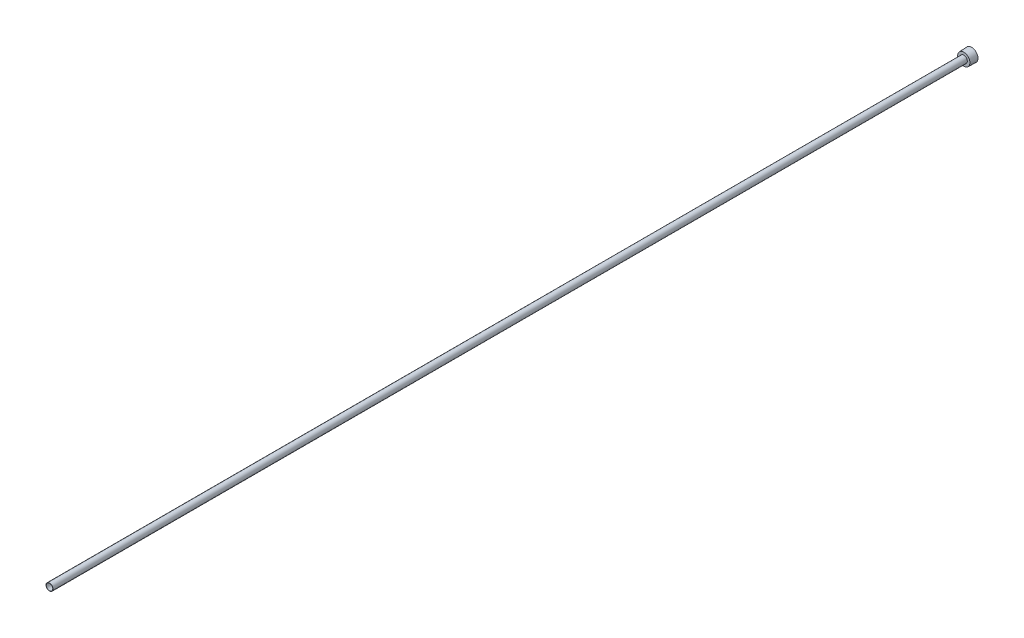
from build123d import *

# Parameters (mm, degrees)
SKETCH2_R          = 4.318
CUT_EXTRUDE1_DEPTH = 1220.258853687
CUT_EXTRUDE2_DEPTH = 6.35


with BuildPart() as part:
    # Sketch1 → Revolve1 (revolve)
    with BuildSketch(Plane(origin=(0, 0, 0), x_dir=(0, 0, -1), z_dir=(1, 0, 0)), mode=Mode.PRIVATE) as revolve1_sk:
        Polygon((0, 0), (0, 8.4709), (-10.3124, 8.094743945), (-10.3124, 4.6355), (-1219.2, 4.6355), (-1219.2, 0), align=None)
    revolve(revolve1_sk.sketch.rotate(Axis((0, 0, 168.793426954), (0, 0, -1)), 90), axis=Axis((0, 0, 168.793426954), (0, 0, -1)))

    # Sketch2 → Cut-Extrude1 (cut, through all)
    with BuildSketch(Plane.XY.offset(1219.2)):
        Circle(SKETCH2_R)
    extrude(amount=-CUT_EXTRUDE1_DEPTH, mode=Mode.SUBTRACT)

    # Sketch3 → Cut-Extrude2 (cut)
    with BuildSketch(Plane(origin=(0, 0, 0), x_dir=(-1, 0, 0), z_dir=(0, 0, -1))):
        Polygon((-4.7625, -2.749630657), (0, -5.499261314), (4.7625, -2.749630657), (4.7625, 2.749630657), (0, 5.499261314), (-4.7625, 2.749630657), align=None)
    extrude(amount=-CUT_EXTRUDE2_DEPTH, mode=Mode.SUBTRACT)


solid = part.part
